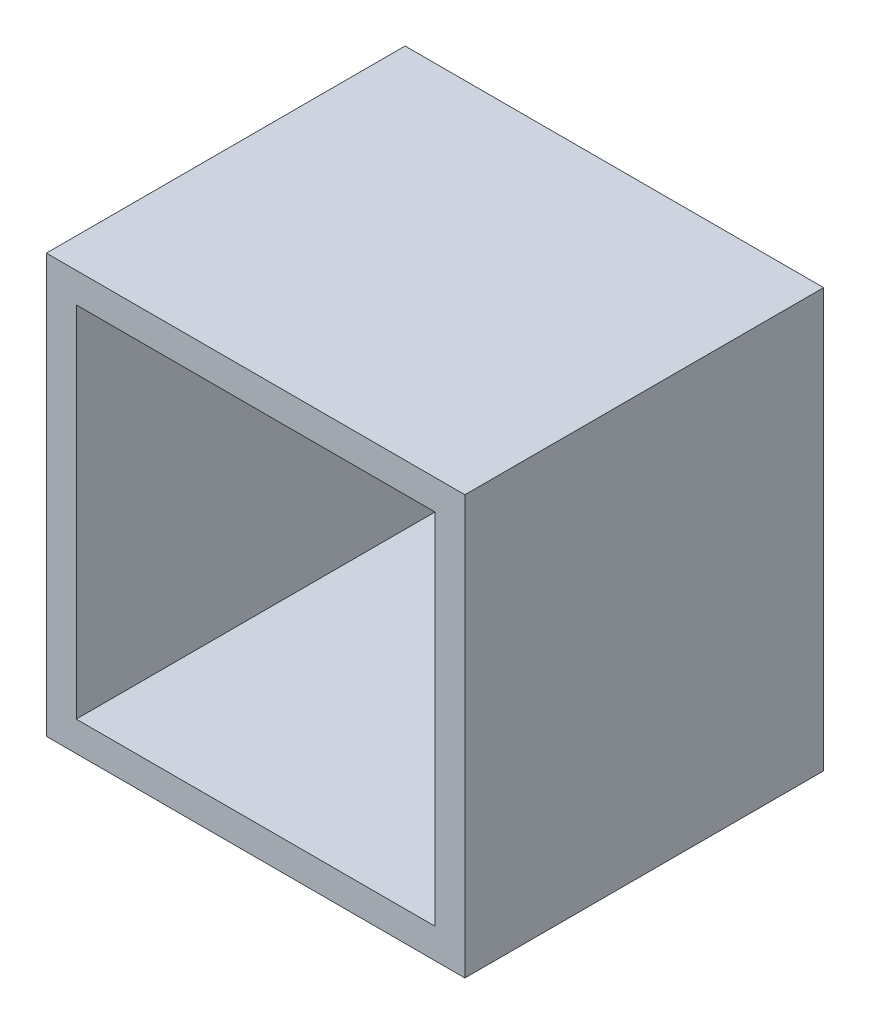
from build123d import *

# Parameters (mm, degrees)
SKETCH2_W      = 355.6
SKETCH2_H      = 355.6
SKETCH2_W_2    = 304.8
SKETCH2_H_2    = 304.8
EXTRUDE1_DEPTH = 304.8


with BuildPart() as part:
    # Sketch2 → Extrude1 (new body)
    with BuildSketch(Plane.XY):
        Rectangle(SKETCH2_W, SKETCH2_H)
        Rectangle(SKETCH2_W_2, SKETCH2_H_2, mode=Mode.SUBTRACT)
    extrude(amount=EXTRUDE1_DEPTH)


solid = part.part
